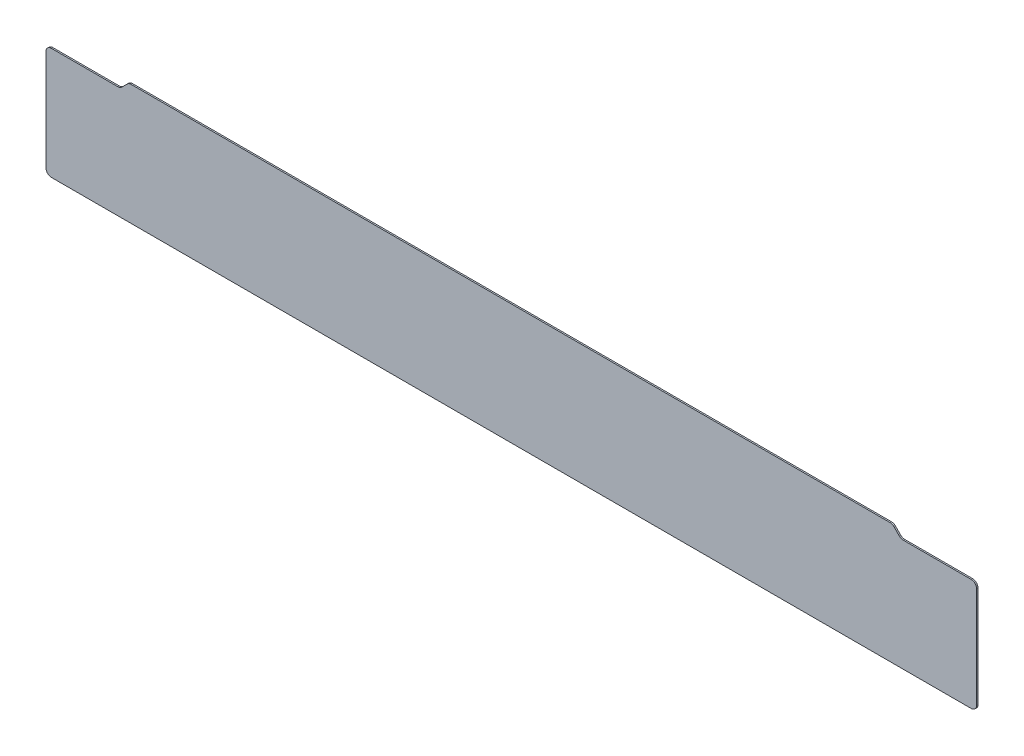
ISO-10303-21;
HEADER;
FILE_DESCRIPTION(('STEP AP214'),'2;1');
FILE_NAME('part.step','',(''),(''),'','','');
FILE_SCHEMA(('AUTOMOTIVE_DESIGN { 1 0 10303 214 1 1 1 1 }'));
ENDSEC;
DATA;
#1=APPLICATION_CONTEXT('core data for automotive mechanical design processes');
#2=APPLICATION_PROTOCOL_DEFINITION('international standard','automotive_design',2000,#1);
#3=PRODUCT_CONTEXT('',#1,'mechanical');
#4=PRODUCT('Part','Part','',(#3));
#5=PRODUCT_RELATED_PRODUCT_CATEGORY('part','',(#4));
#6=PRODUCT_DEFINITION_FORMATION('','',#4);
#7=PRODUCT_DEFINITION_CONTEXT('part definition',#1,'design');
#8=PRODUCT_DEFINITION('design','',#6,#7);
#9=PRODUCT_DEFINITION_SHAPE('','',#8);
#10=(LENGTH_UNIT() NAMED_UNIT(*) SI_UNIT(.MILLI.,.METRE.));
#11=(NAMED_UNIT(*) PLANE_ANGLE_UNIT() SI_UNIT($,.RADIAN.));
#12=(NAMED_UNIT(*) SI_UNIT($,.STERADIAN.) SOLID_ANGLE_UNIT());
#13=UNCERTAINTY_MEASURE_WITH_UNIT(LENGTH_MEASURE(1.E-05),#10,'distance_accuracy_value','');
#14=(GEOMETRIC_REPRESENTATION_CONTEXT(3) GLOBAL_UNCERTAINTY_ASSIGNED_CONTEXT((#13)) GLOBAL_UNIT_ASSIGNED_CONTEXT((#10,
#11,#12)) REPRESENTATION_CONTEXT('',''));
#15=CARTESIAN_POINT('',(0.,0.,0.));
#16=DIRECTION('',(0.,0.,1.));
#17=DIRECTION('',(1.,0.,0.));
#18=AXIS2_PLACEMENT_3D('',#15,#16,#17);
#19=CARTESIAN_POINT('',(0.,0.,0.8));
#20=DIRECTION('',(0.,0.,1.));
#21=DIRECTION('',(1.,0.,0.));
#22=AXIS2_PLACEMENT_3D('',#19,#20,#21);
#23=PLANE('',#22);
#24=DIRECTION('',(0.,1.,0.));
#25=VECTOR('',#24,1.);
#26=CARTESIAN_POINT('',(17.4708905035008,0.,0.8));
#27=LINE('',#26,#25);
#28=CARTESIAN_POINT('',(17.4708905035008,192.10201589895,0.8));
#29=VERTEX_POINT('',#28);
#30=CARTESIAN_POINT('',(17.4708905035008,248.90201589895,0.8));
#31=VERTEX_POINT('',#30);
#32=EDGE_CURVE('E158',#29,#31,#27,.T.);
#33=ORIENTED_EDGE('',*,*,#32,.F.);
#34=CARTESIAN_POINT('',(20.4708905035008,192.10201589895,0.8));
#35=DIRECTION('',(0.,0.,-1.));
#36=DIRECTION('',(-1.,0.,0.));
#37=AXIS2_PLACEMENT_3D('',#34,#35,#36);
#38=CIRCLE('',#37,3.);
#39=CARTESIAN_POINT('',(20.4708905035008,189.10201589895,0.8));
#40=VERTEX_POINT('',#39);
#41=EDGE_CURVE('E208',#40,#29,#38,.T.);
#42=ORIENTED_EDGE('',*,*,#41,.F.);
#43=DIRECTION('',(1.,0.,0.));
#44=VECTOR('',#43,1.);
#45=CARTESIAN_POINT('',(0.,189.10201589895,0.8));
#46=LINE('',#45,#44);
#47=CARTESIAN_POINT('',(537.241857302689,189.10201589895,0.8));
#48=VERTEX_POINT('',#47);
#49=EDGE_CURVE('E154',#48,#40,#46,.F.);
#50=ORIENTED_EDGE('',*,*,#49,.F.);
#51=CARTESIAN_POINT('',(537.241857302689,192.10201589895,0.8));
#52=DIRECTION('',(0.,0.,1.));
#53=DIRECTION('',(1.,0.,0.));
#54=AXIS2_PLACEMENT_3D('',#51,#52,#53);
#55=CIRCLE('',#54,3.);
#56=CARTESIAN_POINT('',(540.241857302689,192.10201589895,0.8));
#57=VERTEX_POINT('',#56);
#58=EDGE_CURVE('E205',#57,#48,#55,.F.);
#59=ORIENTED_EDGE('',*,*,#58,.F.);
#60=DIRECTION('',(0.,1.,0.));
#61=VECTOR('',#60,1.);
#62=CARTESIAN_POINT('',(540.241857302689,0.,0.8));
#63=LINE('',#62,#61);
#64=CARTESIAN_POINT('',(540.241857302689,248.90201589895,0.8));
#65=VERTEX_POINT('',#64);
#66=EDGE_CURVE('E141',#57,#65,#63,.T.);
#67=ORIENTED_EDGE('',*,*,#66,.T.);
#68=CARTESIAN_POINT('',(537.241857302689,248.90201589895,0.8));
#69=DIRECTION('',(0.,0.,1.));
#70=DIRECTION('',(1.,0.,0.));
#71=AXIS2_PLACEMENT_3D('',#68,#69,#70);
#72=CIRCLE('',#71,3.);
#73=CARTESIAN_POINT('',(537.241857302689,251.90201589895,0.8));
#74=VERTEX_POINT('',#73);
#75=EDGE_CURVE('E20',#74,#65,#72,.F.);
#76=ORIENTED_EDGE('',*,*,#75,.F.);
#77=DIRECTION('',(-1.,0.,0.));
#78=VECTOR('',#77,1.);
#79=CARTESIAN_POINT('',(1.31705413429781E-12,251.902015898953,0.8));
#80=LINE('',#79,#78);
#81=CARTESIAN_POINT('',(499.015868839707,251.902015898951,0.8));
#82=VERTEX_POINT('',#81);
#83=EDGE_CURVE('E126',#82,#74,#80,.F.);
#84=ORIENTED_EDGE('',*,*,#83,.F.);
#85=CARTESIAN_POINT('',(499.015868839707,254.902015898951,0.8));
#86=DIRECTION('',(0.,0.,1.));
#87=DIRECTION('',(1.,0.,0.));
#88=AXIS2_PLACEMENT_3D('',#85,#86,#87);
#89=CIRCLE('',#88,3.);
#90=CARTESIAN_POINT('',(496.894548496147,252.780695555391,0.8));
#91=VERTEX_POINT('',#90);
#92=EDGE_CURVE('E149',#82,#91,#89,.F.);
#93=ORIENTED_EDGE('',*,*,#92,.T.);
#94=DIRECTION('',(-0.707106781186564,0.707106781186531,0.));
#95=VECTOR('',#94,1.);
#96=CARTESIAN_POINT('',(374.837622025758,374.837622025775,0.8));
#97=LINE('',#96,#95);
#98=CARTESIAN_POINT('',(493.795053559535,255.880190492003,0.8));
#99=VERTEX_POINT('',#98);
#100=EDGE_CURVE('E174',#99,#91,#97,.F.);
#101=ORIENTED_EDGE('',*,*,#100,.F.);
#102=CARTESIAN_POINT('',(491.673733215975,253.758870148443,0.8));
#103=DIRECTION('',(0.,0.,-1.));
#104=DIRECTION('',(-1.,0.,0.));
#105=AXIS2_PLACEMENT_3D('',#102,#103,#104);
#106=CIRCLE('',#105,3.);
#107=CARTESIAN_POINT('',(491.673733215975,256.758870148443,0.8));
#108=VERTEX_POINT('',#107);
#109=EDGE_CURVE('E217',#108,#99,#106,.T.);
#110=ORIENTED_EDGE('',*,*,#109,.F.);
#111=DIRECTION('',(1.,0.,0.));
#112=VECTOR('',#111,1.);
#113=CARTESIAN_POINT('',(0.,256.758870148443,0.8));
#114=LINE('',#113,#112);
#115=CARTESIAN_POINT('',(65.2390145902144,256.758870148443,0.8));
#116=VERTEX_POINT('',#115);
#117=EDGE_CURVE('E170',#116,#108,#114,.T.);
#118=ORIENTED_EDGE('',*,*,#117,.F.);
#119=CARTESIAN_POINT('',(65.2390145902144,253.758870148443,0.8));
#120=DIRECTION('',(0.,0.,-1.));
#121=DIRECTION('',(-1.,0.,0.));
#122=AXIS2_PLACEMENT_3D('',#119,#120,#121);
#123=CIRCLE('',#122,3.);
#124=CARTESIAN_POINT('',(63.1176942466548,255.880190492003,0.8));
#125=VERTEX_POINT('',#124);
#126=EDGE_CURVE('E215',#125,#116,#123,.T.);
#127=ORIENTED_EDGE('',*,*,#126,.F.);
#128=DIRECTION('',(-0.707106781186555,-0.70710678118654,0.));
#129=VECTOR('',#128,1.);
#130=CARTESIAN_POINT('',(-96.3812481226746,96.3812481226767,0.8));
#131=LINE('',#130,#129);
#132=CARTESIAN_POINT('',(60.0181993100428,252.780695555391,0.8));
#133=VERTEX_POINT('',#132);
#134=EDGE_CURVE('E166',#133,#125,#131,.F.);
#135=ORIENTED_EDGE('',*,*,#134,.F.);
#136=CARTESIAN_POINT('',(57.8968789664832,254.90201589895,0.8));
#137=DIRECTION('',(0.,0.,1.));
#138=DIRECTION('',(1.,0.,0.));
#139=AXIS2_PLACEMENT_3D('',#136,#137,#138);
#140=CIRCLE('',#139,3.);
#141=CARTESIAN_POINT('',(57.8968789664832,251.90201589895,0.8));
#142=VERTEX_POINT('',#141);
#143=EDGE_CURVE('E165',#133,#142,#140,.F.);
#144=ORIENTED_EDGE('',*,*,#143,.T.);
#145=DIRECTION('',(1.,0.,0.));
#146=VECTOR('',#145,1.);
#147=CARTESIAN_POINT('',(0.,251.90201589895,0.8));
#148=LINE('',#147,#146);
#149=CARTESIAN_POINT('',(20.4708905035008,251.90201589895,0.8));
#150=VERTEX_POINT('',#149);
#151=EDGE_CURVE('E162',#150,#142,#148,.T.);
#152=ORIENTED_EDGE('',*,*,#151,.F.);
#153=CARTESIAN_POINT('',(20.4708905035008,248.90201589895,0.8));
#154=DIRECTION('',(0.,0.,-1.));
#155=DIRECTION('',(-1.,0.,0.));
#156=AXIS2_PLACEMENT_3D('',#153,#154,#155);
#157=CIRCLE('',#156,3.);
#158=EDGE_CURVE('E210',#31,#150,#157,.T.);
#159=ORIENTED_EDGE('',*,*,#158,.F.);
#160=EDGE_LOOP('',(#33,#42,#50,#59,#67,#76,#84,#93,#101,#110,#118,#127,#135,#144,#152,#159));
#161=FACE_BOUND('',#160,.T.);
#162=ADVANCED_FACE('F17',(#161),#23,.T.);
#163=CARTESIAN_POINT('',(537.241857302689,248.90201589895,0.8));
#164=DIRECTION('',(0.,0.,1.));
#165=DIRECTION('',(1.,0.,0.));
#166=AXIS2_PLACEMENT_3D('',#163,#164,#165);
#167=CYLINDRICAL_SURFACE('',#166,3.);
#168=CARTESIAN_POINT('',(537.241857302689,248.90201589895,0.));
#169=DIRECTION('',(0.,0.,1.));
#170=DIRECTION('',(1.,0.,0.));
#171=AXIS2_PLACEMENT_3D('',#168,#169,#170);
#172=CIRCLE('',#171,3.);
#173=CARTESIAN_POINT('',(540.241857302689,248.90201589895,0.));
#174=VERTEX_POINT('',#173);
#175=CARTESIAN_POINT('',(537.241857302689,251.90201589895,0.));
#176=VERTEX_POINT('',#175);
#177=EDGE_CURVE('E147',#174,#176,#172,.T.);
#178=ORIENTED_EDGE('',*,*,#177,.T.);
#179=DIRECTION('',(0.,0.,1.));
#180=VECTOR('',#179,1.);
#181=CARTESIAN_POINT('',(537.241857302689,251.90201589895,0.8));
#182=LINE('',#181,#180);
#183=EDGE_CURVE('E131',#74,#176,#182,.F.);
#184=ORIENTED_EDGE('',*,*,#183,.F.);
#185=ORIENTED_EDGE('',*,*,#75,.T.);
#186=DIRECTION('',(0.,0.,1.));
#187=VECTOR('',#186,1.);
#188=CARTESIAN_POINT('',(540.241857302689,248.90201589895,0.8));
#189=LINE('',#188,#187);
#190=EDGE_CURVE('E241',#65,#174,#189,.F.);
#191=ORIENTED_EDGE('',*,*,#190,.T.);
#192=EDGE_LOOP('',(#178,#184,#185,#191));
#193=FACE_BOUND('',#192,.T.);
#194=ADVANCED_FACE('F146',(#193),#167,.T.);
#195=CARTESIAN_POINT('',(1.31705413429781E-12,251.902015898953,0.8));
#196=DIRECTION('',(0.,1.,0.));
#197=DIRECTION('',(-1.,0.,0.));
#198=AXIS2_PLACEMENT_3D('',#195,#196,#197);
#199=PLANE('',#198);
#200=DIRECTION('',(1.,0.,0.));
#201=VECTOR('',#200,1.);
#202=CARTESIAN_POINT('',(0.,251.90201589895,0.));
#203=LINE('',#202,#201);
#204=CARTESIAN_POINT('',(499.015868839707,251.90201589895,0.));
#205=VERTEX_POINT('',#204);
#206=EDGE_CURVE('E203',#176,#205,#203,.F.);
#207=ORIENTED_EDGE('',*,*,#206,.T.);
#208=DIRECTION('',(0.,0.,1.));
#209=VECTOR('',#208,1.);
#210=CARTESIAN_POINT('',(499.015868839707,251.902015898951,0.8));
#211=LINE('',#210,#209);
#212=EDGE_CURVE('E133',#205,#82,#211,.T.);
#213=ORIENTED_EDGE('',*,*,#212,.T.);
#214=ORIENTED_EDGE('',*,*,#83,.T.);
#215=ORIENTED_EDGE('',*,*,#183,.T.);
#216=EDGE_LOOP('',(#207,#213,#214,#215));
#217=FACE_BOUND('',#216,.T.);
#218=ADVANCED_FACE('F129',(#217),#199,.T.);
#219=CARTESIAN_POINT('',(499.015868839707,254.902015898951,0.8));
#220=DIRECTION('',(0.,0.,1.));
#221=DIRECTION('',(1.,0.,0.));
#222=AXIS2_PLACEMENT_3D('',#219,#220,#221);
#223=CYLINDRICAL_SURFACE('',#222,3.);
#224=ORIENTED_EDGE('',*,*,#212,.F.);
#225=CARTESIAN_POINT('',(499.015868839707,254.902015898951,0.));
#226=DIRECTION('',(0.,0.,1.));
#227=DIRECTION('',(1.,0.,0.));
#228=AXIS2_PLACEMENT_3D('',#225,#226,#227);
#229=CIRCLE('',#228,3.);
#230=CARTESIAN_POINT('',(496.894548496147,252.780695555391,0.));
#231=VERTEX_POINT('',#230);
#232=EDGE_CURVE('E200',#205,#231,#229,.F.);
#233=ORIENTED_EDGE('',*,*,#232,.T.);
#234=DIRECTION('',(0.,0.,1.));
#235=VECTOR('',#234,1.);
#236=CARTESIAN_POINT('',(496.894548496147,252.780695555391,0.8));
#237=LINE('',#236,#235);
#238=EDGE_CURVE('E175',#91,#231,#237,.F.);
#239=ORIENTED_EDGE('',*,*,#238,.F.);
#240=ORIENTED_EDGE('',*,*,#92,.F.);
#241=EDGE_LOOP('',(#224,#233,#239,#240));
#242=FACE_BOUND('',#241,.T.);
#243=ADVANCED_FACE('F223',(#242),#223,.F.);
#244=CARTESIAN_POINT('',(374.837622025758,374.837622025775,0.8));
#245=DIRECTION('',(0.707106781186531,0.707106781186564,0.));
#246=DIRECTION('',(-0.707106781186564,0.707106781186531,0.));
#247=AXIS2_PLACEMENT_3D('',#244,#245,#246);
#248=PLANE('',#247);
#249=DIRECTION('',(-0.707106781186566,0.707106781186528,0.));
#250=VECTOR('',#249,1.);
#251=CARTESIAN_POINT('',(496.894548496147,252.780695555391,0.));
#252=LINE('',#251,#250);
#253=CARTESIAN_POINT('',(493.795053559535,255.880190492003,0.));
#254=VERTEX_POINT('',#253);
#255=EDGE_CURVE('E199',#231,#254,#252,.T.);
#256=ORIENTED_EDGE('',*,*,#255,.T.);
#257=DIRECTION('',(0.,0.,-1.));
#258=VECTOR('',#257,1.);
#259=CARTESIAN_POINT('',(493.795053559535,255.880190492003,0.8));
#260=LINE('',#259,#258);
#261=EDGE_CURVE('E173',#99,#254,#260,.T.);
#262=ORIENTED_EDGE('',*,*,#261,.F.);
#263=ORIENTED_EDGE('',*,*,#100,.T.);
#264=ORIENTED_EDGE('',*,*,#238,.T.);
#265=EDGE_LOOP('',(#256,#262,#263,#264));
#266=FACE_BOUND('',#265,.T.);
#267=ADVANCED_FACE('F303',(#266),#248,.T.);
#268=CARTESIAN_POINT('',(491.673733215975,253.758870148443,0.8));
#269=DIRECTION('',(0.,0.,-1.));
#270=DIRECTION('',(-1.,0.,0.));
#271=AXIS2_PLACEMENT_3D('',#268,#269,#270);
#272=CYLINDRICAL_SURFACE('',#271,3.);
#273=CARTESIAN_POINT('',(491.673733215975,253.758870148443,0.));
#274=DIRECTION('',(0.,0.,-1.));
#275=DIRECTION('',(-1.,0.,0.));
#276=AXIS2_PLACEMENT_3D('',#273,#274,#275);
#277=CIRCLE('',#276,3.);
#278=CARTESIAN_POINT('',(491.673733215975,256.758870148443,0.));
#279=VERTEX_POINT('',#278);
#280=EDGE_CURVE('E196',#254,#279,#277,.F.);
#281=ORIENTED_EDGE('',*,*,#280,.T.);
#282=DIRECTION('',(0.,0.,1.));
#283=VECTOR('',#282,1.);
#284=CARTESIAN_POINT('',(491.673733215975,256.758870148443,0.8));
#285=LINE('',#284,#283);
#286=EDGE_CURVE('E172',#108,#279,#285,.F.);
#287=ORIENTED_EDGE('',*,*,#286,.F.);
#288=ORIENTED_EDGE('',*,*,#109,.T.);
#289=ORIENTED_EDGE('',*,*,#261,.T.);
#290=EDGE_LOOP('',(#281,#287,#288,#289));
#291=FACE_BOUND('',#290,.T.);
#292=ADVANCED_FACE('F302',(#291),#272,.T.);
#293=CARTESIAN_POINT('',(0.,256.758870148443,0.8));
#294=DIRECTION('',(0.,1.,0.));
#295=DIRECTION('',(0.,0.,1.));
#296=AXIS2_PLACEMENT_3D('',#293,#294,#295);
#297=PLANE('',#296);
#298=DIRECTION('',(1.,0.,0.));
#299=VECTOR('',#298,1.);
#300=CARTESIAN_POINT('',(0.,256.758870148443,0.));
#301=LINE('',#300,#299);
#302=CARTESIAN_POINT('',(65.2390145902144,256.758870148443,0.));
#303=VERTEX_POINT('',#302);
#304=EDGE_CURVE('E195',#279,#303,#301,.F.);
#305=ORIENTED_EDGE('',*,*,#304,.T.);
#306=DIRECTION('',(0.,0.,-1.));
#307=VECTOR('',#306,1.);
#308=CARTESIAN_POINT('',(65.2390145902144,256.758870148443,0.8));
#309=LINE('',#308,#307);
#310=EDGE_CURVE('E169',#116,#303,#309,.T.);
#311=ORIENTED_EDGE('',*,*,#310,.F.);
#312=ORIENTED_EDGE('',*,*,#117,.T.);
#313=ORIENTED_EDGE('',*,*,#286,.T.);
#314=EDGE_LOOP('',(#305,#311,#312,#313));
#315=FACE_BOUND('',#314,.T.);
#316=ADVANCED_FACE('F298',(#315),#297,.T.);
#317=CARTESIAN_POINT('',(65.2390145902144,253.758870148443,0.8));
#318=DIRECTION('',(0.,0.,-1.));
#319=DIRECTION('',(-1.,0.,0.));
#320=AXIS2_PLACEMENT_3D('',#317,#318,#319);
#321=CYLINDRICAL_SURFACE('',#320,3.);
#322=CARTESIAN_POINT('',(65.2390145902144,253.758870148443,0.));
#323=DIRECTION('',(0.,0.,-1.));
#324=DIRECTION('',(-1.,0.,0.));
#325=AXIS2_PLACEMENT_3D('',#322,#323,#324);
#326=CIRCLE('',#325,3.);
#327=CARTESIAN_POINT('',(63.1176942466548,255.880190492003,0.));
#328=VERTEX_POINT('',#327);
#329=EDGE_CURVE('E192',#303,#328,#326,.F.);
#330=ORIENTED_EDGE('',*,*,#329,.T.);
#331=DIRECTION('',(0.,0.,1.));
#332=VECTOR('',#331,1.);
#333=CARTESIAN_POINT('',(63.1176942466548,255.880190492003,0.8));
#334=LINE('',#333,#332);
#335=EDGE_CURVE('E168',#125,#328,#334,.F.);
#336=ORIENTED_EDGE('',*,*,#335,.F.);
#337=ORIENTED_EDGE('',*,*,#126,.T.);
#338=ORIENTED_EDGE('',*,*,#310,.T.);
#339=EDGE_LOOP('',(#330,#336,#337,#338));
#340=FACE_BOUND('',#339,.T.);
#341=ADVANCED_FACE('F294',(#340),#321,.T.);
#342=CARTESIAN_POINT('',(-96.3812481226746,96.3812481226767,0.8));
#343=DIRECTION('',(-0.70710678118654,0.707106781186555,0.));
#344=DIRECTION('',(-0.707106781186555,-0.70710678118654,0.));
#345=AXIS2_PLACEMENT_3D('',#342,#343,#344);
#346=PLANE('',#345);
#347=ORIENTED_EDGE('',*,*,#134,.T.);
#348=ORIENTED_EDGE('',*,*,#335,.T.);
#349=DIRECTION('',(-0.707106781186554,-0.707106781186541,0.));
#350=VECTOR('',#349,1.);
#351=CARTESIAN_POINT('',(63.1176942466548,255.880190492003,0.));
#352=LINE('',#351,#350);
#353=CARTESIAN_POINT('',(60.0181993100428,252.780695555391,0.));
#354=VERTEX_POINT('',#353);
#355=EDGE_CURVE('E191',#328,#354,#352,.T.);
#356=ORIENTED_EDGE('',*,*,#355,.T.);
#357=DIRECTION('',(0.,0.,1.));
#358=VECTOR('',#357,1.);
#359=CARTESIAN_POINT('',(60.0181993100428,252.780695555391,0.8));
#360=LINE('',#359,#358);
#361=EDGE_CURVE('E214',#354,#133,#360,.T.);
#362=ORIENTED_EDGE('',*,*,#361,.T.);
#363=EDGE_LOOP('',(#347,#348,#356,#362));
#364=FACE_BOUND('',#363,.T.);
#365=ADVANCED_FACE('F288',(#364),#346,.T.);
#366=CARTESIAN_POINT('',(57.8968789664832,254.90201589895,0.8));
#367=DIRECTION('',(0.,0.,1.));
#368=DIRECTION('',(1.,0.,0.));
#369=AXIS2_PLACEMENT_3D('',#366,#367,#368);
#370=CYLINDRICAL_SURFACE('',#369,3.);
#371=ORIENTED_EDGE('',*,*,#361,.F.);
#372=CARTESIAN_POINT('',(57.8968789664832,254.90201589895,0.));
#373=DIRECTION('',(0.,0.,1.));
#374=DIRECTION('',(1.,0.,0.));
#375=AXIS2_PLACEMENT_3D('',#372,#373,#374);
#376=CIRCLE('',#375,3.);
#377=CARTESIAN_POINT('',(57.8968789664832,251.90201589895,0.));
#378=VERTEX_POINT('',#377);
#379=EDGE_CURVE('E188',#354,#378,#376,.F.);
#380=ORIENTED_EDGE('',*,*,#379,.T.);
#381=DIRECTION('',(0.,0.,1.));
#382=VECTOR('',#381,1.);
#383=CARTESIAN_POINT('',(57.8968789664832,251.90201589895,0.8));
#384=LINE('',#383,#382);
#385=EDGE_CURVE('E164',#142,#378,#384,.F.);
#386=ORIENTED_EDGE('',*,*,#385,.F.);
#387=ORIENTED_EDGE('',*,*,#143,.F.);
#388=EDGE_LOOP('',(#371,#380,#386,#387));
#389=FACE_BOUND('',#388,.T.);
#390=ADVANCED_FACE('F285',(#389),#370,.F.);
#391=CARTESIAN_POINT('',(0.,251.90201589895,0.8));
#392=DIRECTION('',(0.,1.,0.));
#393=DIRECTION('',(0.,0.,1.));
#394=AXIS2_PLACEMENT_3D('',#391,#392,#393);
#395=PLANE('',#394);
#396=ORIENTED_EDGE('',*,*,#151,.T.);
#397=ORIENTED_EDGE('',*,*,#385,.T.);
#398=DIRECTION('',(1.,0.,0.));
#399=VECTOR('',#398,1.);
#400=CARTESIAN_POINT('',(0.,251.90201589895,0.));
#401=LINE('',#400,#399);
#402=CARTESIAN_POINT('',(20.4708905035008,251.90201589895,0.));
#403=VERTEX_POINT('',#402);
#404=EDGE_CURVE('E187',#378,#403,#401,.F.);
#405=ORIENTED_EDGE('',*,*,#404,.T.);
#406=DIRECTION('',(0.,0.,-1.));
#407=VECTOR('',#406,1.);
#408=CARTESIAN_POINT('',(20.4708905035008,251.90201589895,0.8));
#409=LINE('',#408,#407);
#410=EDGE_CURVE('E161',#150,#403,#409,.T.);
#411=ORIENTED_EDGE('',*,*,#410,.F.);
#412=EDGE_LOOP('',(#396,#397,#405,#411));
#413=FACE_BOUND('',#412,.T.);
#414=ADVANCED_FACE('F280',(#413),#395,.T.);
#415=CARTESIAN_POINT('',(20.4708905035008,248.90201589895,0.8));
#416=DIRECTION('',(0.,0.,-1.));
#417=DIRECTION('',(-1.,0.,0.));
#418=AXIS2_PLACEMENT_3D('',#415,#416,#417);
#419=CYLINDRICAL_SURFACE('',#418,3.);
#420=CARTESIAN_POINT('',(20.4708905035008,248.90201589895,0.));
#421=DIRECTION('',(0.,0.,-1.));
#422=DIRECTION('',(-1.,0.,0.));
#423=AXIS2_PLACEMENT_3D('',#420,#421,#422);
#424=CIRCLE('',#423,3.);
#425=CARTESIAN_POINT('',(17.4708905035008,248.90201589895,0.));
#426=VERTEX_POINT('',#425);
#427=EDGE_CURVE('E184',#403,#426,#424,.F.);
#428=ORIENTED_EDGE('',*,*,#427,.T.);
#429=DIRECTION('',(0.,0.,1.));
#430=VECTOR('',#429,1.);
#431=CARTESIAN_POINT('',(17.4708905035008,248.90201589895,0.8));
#432=LINE('',#431,#430);
#433=EDGE_CURVE('E160',#31,#426,#432,.F.);
#434=ORIENTED_EDGE('',*,*,#433,.F.);
#435=ORIENTED_EDGE('',*,*,#158,.T.);
#436=ORIENTED_EDGE('',*,*,#410,.T.);
#437=EDGE_LOOP('',(#428,#434,#435,#436));
#438=FACE_BOUND('',#437,.T.);
#439=ADVANCED_FACE('F276',(#438),#419,.T.);
#440=CARTESIAN_POINT('',(17.4708905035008,0.,0.8));
#441=DIRECTION('',(-1.,0.,0.));
#442=DIRECTION('',(0.,0.,1.));
#443=AXIS2_PLACEMENT_3D('',#440,#441,#442);
#444=PLANE('',#443);
#445=ORIENTED_EDGE('',*,*,#32,.T.);
#446=ORIENTED_EDGE('',*,*,#433,.T.);
#447=DIRECTION('',(0.,1.,0.));
#448=VECTOR('',#447,1.);
#449=CARTESIAN_POINT('',(17.4708905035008,0.,0.));
#450=LINE('',#449,#448);
#451=CARTESIAN_POINT('',(17.4708905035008,192.10201589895,0.));
#452=VERTEX_POINT('',#451);
#453=EDGE_CURVE('E183',#426,#452,#450,.F.);
#454=ORIENTED_EDGE('',*,*,#453,.T.);
#455=DIRECTION('',(0.,0.,-1.));
#456=VECTOR('',#455,1.);
#457=CARTESIAN_POINT('',(17.4708905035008,192.10201589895,0.8));
#458=LINE('',#457,#456);
#459=EDGE_CURVE('E157',#29,#452,#458,.T.);
#460=ORIENTED_EDGE('',*,*,#459,.F.);
#461=EDGE_LOOP('',(#445,#446,#454,#460));
#462=FACE_BOUND('',#461,.T.);
#463=ADVANCED_FACE('F270',(#462),#444,.T.);
#464=CARTESIAN_POINT('',(20.4708905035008,192.10201589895,0.8));
#465=DIRECTION('',(0.,0.,-1.));
#466=DIRECTION('',(-1.,0.,0.));
#467=AXIS2_PLACEMENT_3D('',#464,#465,#466);
#468=CYLINDRICAL_SURFACE('',#467,3.);
#469=CARTESIAN_POINT('',(20.4708905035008,192.10201589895,0.));
#470=DIRECTION('',(0.,0.,-1.));
#471=DIRECTION('',(-1.,0.,0.));
#472=AXIS2_PLACEMENT_3D('',#469,#470,#471);
#473=CIRCLE('',#472,3.);
#474=CARTESIAN_POINT('',(20.4708905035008,189.10201589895,0.));
#475=VERTEX_POINT('',#474);
#476=EDGE_CURVE('E180',#452,#475,#473,.F.);
#477=ORIENTED_EDGE('',*,*,#476,.T.);
#478=DIRECTION('',(0.,0.,-1.));
#479=VECTOR('',#478,1.);
#480=CARTESIAN_POINT('',(20.4708905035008,189.10201589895,0.8));
#481=LINE('',#480,#479);
#482=EDGE_CURVE('E156',#40,#475,#481,.T.);
#483=ORIENTED_EDGE('',*,*,#482,.F.);
#484=ORIENTED_EDGE('',*,*,#41,.T.);
#485=ORIENTED_EDGE('',*,*,#459,.T.);
#486=EDGE_LOOP('',(#477,#483,#484,#485));
#487=FACE_BOUND('',#486,.T.);
#488=ADVANCED_FACE('F266',(#487),#468,.T.);
#489=CARTESIAN_POINT('',(0.,189.10201589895,0.8));
#490=DIRECTION('',(0.,-1.,0.));
#491=DIRECTION('',(0.,0.,-1.));
#492=AXIS2_PLACEMENT_3D('',#489,#490,#491);
#493=PLANE('',#492);
#494=ORIENTED_EDGE('',*,*,#49,.T.);
#495=ORIENTED_EDGE('',*,*,#482,.T.);
#496=DIRECTION('',(1.,0.,0.));
#497=VECTOR('',#496,1.);
#498=CARTESIAN_POINT('',(0.,189.10201589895,0.));
#499=LINE('',#498,#497);
#500=CARTESIAN_POINT('',(537.241857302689,189.10201589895,0.));
#501=VERTEX_POINT('',#500);
#502=EDGE_CURVE('E179',#475,#501,#499,.T.);
#503=ORIENTED_EDGE('',*,*,#502,.T.);
#504=DIRECTION('',(0.,0.,1.));
#505=VECTOR('',#504,1.);
#506=CARTESIAN_POINT('',(537.241857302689,189.10201589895,0.8));
#507=LINE('',#506,#505);
#508=EDGE_CURVE('E207',#48,#501,#507,.F.);
#509=ORIENTED_EDGE('',*,*,#508,.F.);
#510=EDGE_LOOP('',(#494,#495,#503,#509));
#511=FACE_BOUND('',#510,.T.);
#512=ADVANCED_FACE('F258',(#511),#493,.T.);
#513=CARTESIAN_POINT('',(537.241857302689,192.10201589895,0.8));
#514=DIRECTION('',(0.,0.,1.));
#515=DIRECTION('',(1.,0.,0.));
#516=AXIS2_PLACEMENT_3D('',#513,#514,#515);
#517=CYLINDRICAL_SURFACE('',#516,3.);
#518=CARTESIAN_POINT('',(537.241857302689,192.10201589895,0.));
#519=DIRECTION('',(0.,0.,1.));
#520=DIRECTION('',(1.,0.,0.));
#521=AXIS2_PLACEMENT_3D('',#518,#519,#520);
#522=CIRCLE('',#521,3.);
#523=CARTESIAN_POINT('',(540.241857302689,192.10201589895,0.));
#524=VERTEX_POINT('',#523);
#525=EDGE_CURVE('E26',#501,#524,#522,.T.);
#526=ORIENTED_EDGE('',*,*,#525,.T.);
#527=DIRECTION('',(0.,0.,1.));
#528=VECTOR('',#527,1.);
#529=CARTESIAN_POINT('',(540.241857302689,192.10201589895,0.8));
#530=LINE('',#529,#528);
#531=EDGE_CURVE('E34',#524,#57,#530,.T.);
#532=ORIENTED_EDGE('',*,*,#531,.T.);
#533=ORIENTED_EDGE('',*,*,#58,.T.);
#534=ORIENTED_EDGE('',*,*,#508,.T.);
#535=EDGE_LOOP('',(#526,#532,#533,#534));
#536=FACE_BOUND('',#535,.T.);
#537=ADVANCED_FACE('F306',(#536),#517,.T.);
#538=CARTESIAN_POINT('',(540.241857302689,0.,0.8));
#539=DIRECTION('',(-1.,0.,0.));
#540=DIRECTION('',(0.,0.,1.));
#541=AXIS2_PLACEMENT_3D('',#538,#539,#540);
#542=PLANE('',#541);
#543=ORIENTED_EDGE('',*,*,#531,.F.);
#544=DIRECTION('',(0.,1.,0.));
#545=VECTOR('',#544,1.);
#546=CARTESIAN_POINT('',(540.241857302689,0.,0.));
#547=LINE('',#546,#545);
#548=EDGE_CURVE('E11',#524,#174,#547,.T.);
#549=ORIENTED_EDGE('',*,*,#548,.T.);
#550=ORIENTED_EDGE('',*,*,#190,.F.);
#551=ORIENTED_EDGE('',*,*,#66,.F.);
#552=EDGE_LOOP('',(#543,#549,#550,#551));
#553=FACE_BOUND('',#552,.T.);
#554=ADVANCED_FACE('F304',(#553),#542,.F.);
#555=CARTESIAN_POINT('',(0.,0.,0.));
#556=DIRECTION('',(0.,0.,1.));
#557=DIRECTION('',(1.,0.,0.));
#558=AXIS2_PLACEMENT_3D('',#555,#556,#557);
#559=PLANE('',#558);
#560=ORIENTED_EDGE('',*,*,#525,.F.);
#561=ORIENTED_EDGE('',*,*,#502,.F.);
#562=ORIENTED_EDGE('',*,*,#476,.F.);
#563=ORIENTED_EDGE('',*,*,#453,.F.);
#564=ORIENTED_EDGE('',*,*,#427,.F.);
#565=ORIENTED_EDGE('',*,*,#404,.F.);
#566=ORIENTED_EDGE('',*,*,#379,.F.);
#567=ORIENTED_EDGE('',*,*,#355,.F.);
#568=ORIENTED_EDGE('',*,*,#329,.F.);
#569=ORIENTED_EDGE('',*,*,#304,.F.);
#570=ORIENTED_EDGE('',*,*,#280,.F.);
#571=ORIENTED_EDGE('',*,*,#255,.F.);
#572=ORIENTED_EDGE('',*,*,#232,.F.);
#573=ORIENTED_EDGE('',*,*,#206,.F.);
#574=ORIENTED_EDGE('',*,*,#177,.F.);
#575=ORIENTED_EDGE('',*,*,#548,.F.);
#576=EDGE_LOOP('',(#560,#561,#562,#563,#564,#565,#566,#567,#568,#569,#570,#571,#572,#573,#574,#575));
#577=FACE_BOUND('',#576,.T.);
#578=ADVANCED_FACE('F263',(#577),#559,.F.);
#579=CLOSED_SHELL('',(#162,#194,#218,#243,#267,#292,#316,#341,#365,#390,#414,#439,#463,#488,
#512,#537,#554,#578));
#580=MANIFOLD_SOLID_BREP('B1',#579);
#581=ADVANCED_BREP_SHAPE_REPRESENTATION('',(#18,#580),#14);
#582=SHAPE_DEFINITION_REPRESENTATION(#9,#581);
ENDSEC;
END-ISO-10303-21;
